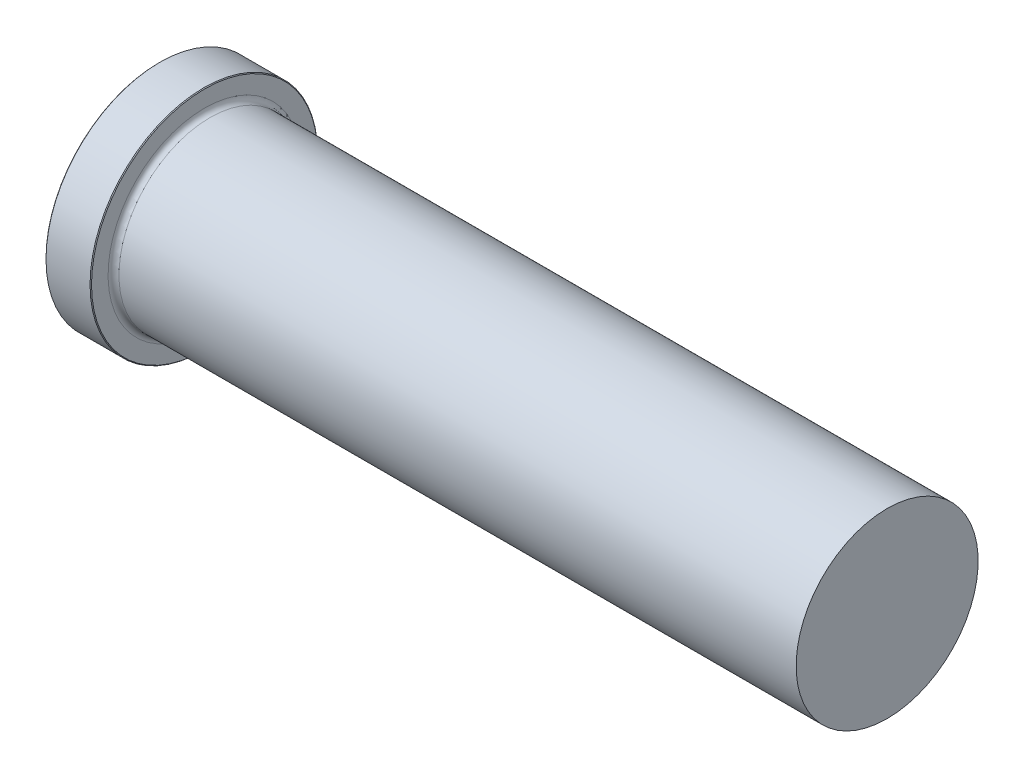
from build123d import *

# Parameters (mm, degrees)
CHAMFER1_SIZE = 0.1016


with BuildPart() as part:
    # Sketch1 → Revolve1 (revolve)
    with BuildSketch(Plane.XY):
        with BuildLine():
            Line((0, 0), (0, 15.875))
            Line((0, 15.875), (6.35, 15.875))
            Line((6.35, 15.875), (6.35, 13.462))
            ThreePointArc((6.35, 13.462), (6.573184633, 12.923184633), (7.112, 12.7))
            Line((7.112, 12.7), (101.6, 12.7))
            Line((101.6, 12.7), (101.6, 0))
            Line((101.6, 0), (0, 0))
        make_face()
    revolve(axis=Axis((101.6, 0, 0), (-1, 0, 0)))

    # Chamfer1
    chamfer1_edges = [part.edges().sort_by_distance(p)[0] for p in [
        (0, -15.875, 0),
        (6.35, -15.875, 0),
    ]]
    chamfer(chamfer1_edges, length=CHAMFER1_SIZE)


solid = part.part
